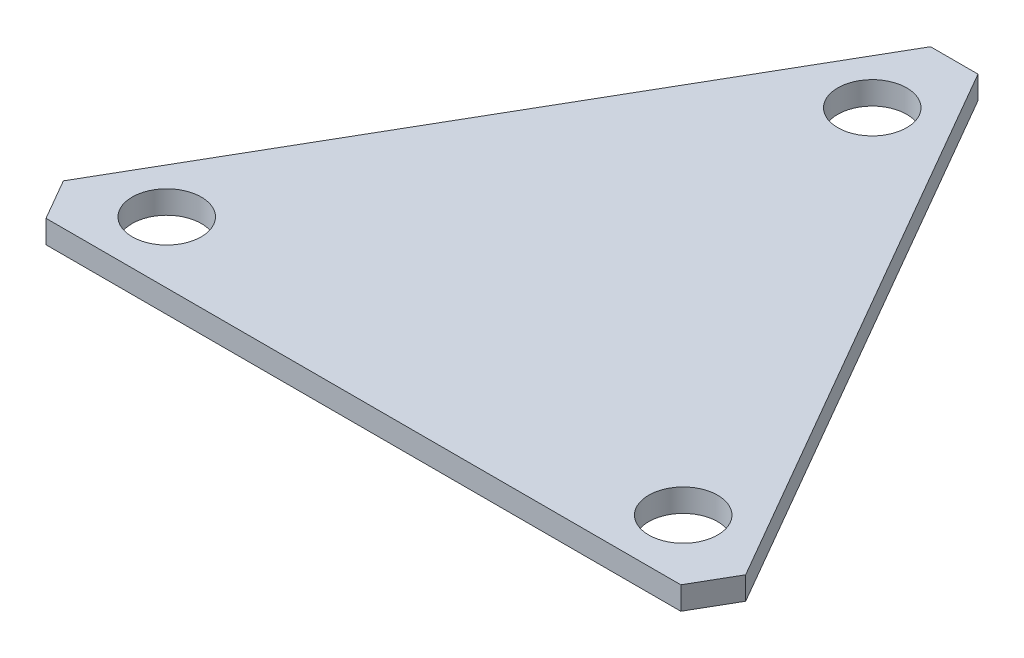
ISO-10303-21;
HEADER;
FILE_DESCRIPTION(('STEP AP214'),'2;1');
FILE_NAME('part.step','',(''),(''),'','','');
FILE_SCHEMA(('AUTOMOTIVE_DESIGN { 1 0 10303 214 1 1 1 1 }'));
ENDSEC;
DATA;
#1=APPLICATION_CONTEXT('core data for automotive mechanical design processes');
#2=APPLICATION_PROTOCOL_DEFINITION('international standard','automotive_design',2000,#1);
#3=PRODUCT_CONTEXT('',#1,'mechanical');
#4=PRODUCT('Part','Part','',(#3));
#5=PRODUCT_RELATED_PRODUCT_CATEGORY('part','',(#4));
#6=PRODUCT_DEFINITION_FORMATION('','',#4);
#7=PRODUCT_DEFINITION_CONTEXT('part definition',#1,'design');
#8=PRODUCT_DEFINITION('design','',#6,#7);
#9=PRODUCT_DEFINITION_SHAPE('','',#8);
#10=(LENGTH_UNIT() NAMED_UNIT(*) SI_UNIT(.MILLI.,.METRE.));
#11=(NAMED_UNIT(*) PLANE_ANGLE_UNIT() SI_UNIT($,.RADIAN.));
#12=(NAMED_UNIT(*) SI_UNIT($,.STERADIAN.) SOLID_ANGLE_UNIT());
#13=UNCERTAINTY_MEASURE_WITH_UNIT(LENGTH_MEASURE(1.E-05),#10,'distance_accuracy_value','');
#14=(GEOMETRIC_REPRESENTATION_CONTEXT(3) GLOBAL_UNCERTAINTY_ASSIGNED_CONTEXT((#13)) GLOBAL_UNIT_ASSIGNED_CONTEXT((#10,
#11,#12)) REPRESENTATION_CONTEXT('',''));
#15=CARTESIAN_POINT('',(0.,0.,0.));
#16=DIRECTION('',(0.,0.,1.));
#17=DIRECTION('',(1.,0.,0.));
#18=AXIS2_PLACEMENT_3D('',#15,#16,#17);
#19=CARTESIAN_POINT('',(-1.64251809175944,1.5875,-26.3143584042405));
#20=DIRECTION('',(0.866025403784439,0.,0.5));
#21=DIRECTION('',(0.5,0.,-0.866025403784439));
#22=AXIS2_PLACEMENT_3D('',#19,#20,#21);
#23=PLANE('',#22);
#24=DIRECTION('',(-0.5,0.,0.866025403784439));
#25=VECTOR('',#24,1.);
#26=CARTESIAN_POINT('',(-1.64251809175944,0.,-26.3143584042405));
#27=LINE('',#26,#25);
#28=CARTESIAN_POINT('',(-1.64251809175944,0.,-26.3143584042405));
#29=VERTEX_POINT('',#28);
#30=CARTESIAN_POINT('',(-23.6101619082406,0.,11.7347168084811));
#31=VERTEX_POINT('',#30);
#32=EDGE_CURVE('E116',#29,#31,#27,.T.);
#33=ORIENTED_EDGE('',*,*,#32,.T.);
#34=DIRECTION('',(0.,-1.,0.));
#35=VECTOR('',#34,1.);
#36=CARTESIAN_POINT('',(-23.6101619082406,1.5875,11.7347168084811));
#37=LINE('',#36,#35);
#38=CARTESIAN_POINT('',(-23.6101619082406,1.5875,11.7347168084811));
#39=VERTEX_POINT('',#38);
#40=EDGE_CURVE('E11',#39,#31,#37,.T.);
#41=ORIENTED_EDGE('',*,*,#40,.F.);
#42=DIRECTION('',(-0.5,0.,0.866025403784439));
#43=VECTOR('',#42,1.);
#44=CARTESIAN_POINT('',(-1.64251809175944,1.5875,-26.3143584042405));
#45=LINE('',#44,#43);
#46=CARTESIAN_POINT('',(-1.64251809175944,1.5875,-26.3143584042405));
#47=VERTEX_POINT('',#46);
#48=EDGE_CURVE('E127',#47,#39,#45,.T.);
#49=ORIENTED_EDGE('',*,*,#48,.F.);
#50=DIRECTION('',(0.,-1.,0.));
#51=VECTOR('',#50,1.);
#52=CARTESIAN_POINT('',(-1.64251809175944,1.5875,-26.3143584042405));
#53=LINE('',#52,#51);
#54=EDGE_CURVE('E112',#47,#29,#53,.T.);
#55=ORIENTED_EDGE('',*,*,#54,.T.);
#56=EDGE_LOOP('',(#33,#41,#49,#55));
#57=FACE_BOUND('',#56,.T.);
#58=ADVANCED_FACE('F32',(#57),#23,.F.);
#59=CARTESIAN_POINT('',(-23.6101619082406,1.5875,11.7347168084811));
#60=DIRECTION('',(0.866025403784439,0.,-0.5));
#61=DIRECTION('',(-0.5,0.,-0.866025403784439));
#62=AXIS2_PLACEMENT_3D('',#59,#60,#61);
#63=PLANE('',#62);
#64=DIRECTION('',(0.5,0.,0.866025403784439));
#65=VECTOR('',#64,1.);
#66=CARTESIAN_POINT('',(-23.6101619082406,0.,11.7347168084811));
#67=LINE('',#66,#65);
#68=CARTESIAN_POINT('',(-21.9676438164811,0.,14.5796415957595));
#69=VERTEX_POINT('',#68);
#70=EDGE_CURVE('E119',#31,#69,#67,.T.);
#71=ORIENTED_EDGE('',*,*,#70,.T.);
#72=DIRECTION('',(0.,-1.,0.));
#73=VECTOR('',#72,1.);
#74=CARTESIAN_POINT('',(-21.9676438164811,1.5875,14.5796415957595));
#75=LINE('',#74,#73);
#76=CARTESIAN_POINT('',(-21.9676438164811,1.5875,14.5796415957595));
#77=VERTEX_POINT('',#76);
#78=EDGE_CURVE('E40',#77,#69,#75,.T.);
#79=ORIENTED_EDGE('',*,*,#78,.F.);
#80=DIRECTION('',(0.5,0.,0.866025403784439));
#81=VECTOR('',#80,1.);
#82=CARTESIAN_POINT('',(-23.6101619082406,1.5875,11.7347168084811));
#83=LINE('',#82,#81);
#84=EDGE_CURVE('E85',#39,#77,#83,.T.);
#85=ORIENTED_EDGE('',*,*,#84,.F.);
#86=ORIENTED_EDGE('',*,*,#40,.T.);
#87=EDGE_LOOP('',(#71,#79,#85,#86));
#88=FACE_BOUND('',#87,.T.);
#89=ADVANCED_FACE('F152',(#88),#63,.F.);
#90=CARTESIAN_POINT('',(-21.9676438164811,1.5875,14.5796415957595));
#91=DIRECTION('',(0.,0.,-1.));
#92=DIRECTION('',(-1.,0.,0.));
#93=AXIS2_PLACEMENT_3D('',#90,#91,#92);
#94=PLANE('',#93);
#95=DIRECTION('',(1.,0.,0.));
#96=VECTOR('',#95,1.);
#97=CARTESIAN_POINT('',(-21.9676438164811,0.,14.5796415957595));
#98=LINE('',#97,#96);
#99=CARTESIAN_POINT('',(21.9676438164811,0.,14.5796415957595));
#100=VERTEX_POINT('',#99);
#101=EDGE_CURVE('E122',#69,#100,#98,.T.);
#102=ORIENTED_EDGE('',*,*,#101,.T.);
#103=DIRECTION('',(0.,-1.,0.));
#104=VECTOR('',#103,1.);
#105=CARTESIAN_POINT('',(21.9676438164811,1.5875,14.5796415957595));
#106=LINE('',#105,#104);
#107=CARTESIAN_POINT('',(21.9676438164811,1.5875,14.5796415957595));
#108=VERTEX_POINT('',#107);
#109=EDGE_CURVE('E107',#108,#100,#106,.T.);
#110=ORIENTED_EDGE('',*,*,#109,.F.);
#111=DIRECTION('',(1.,0.,0.));
#112=VECTOR('',#111,1.);
#113=CARTESIAN_POINT('',(-21.9676438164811,1.5875,14.5796415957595));
#114=LINE('',#113,#112);
#115=EDGE_CURVE('E98',#77,#108,#114,.T.);
#116=ORIENTED_EDGE('',*,*,#115,.F.);
#117=ORIENTED_EDGE('',*,*,#78,.T.);
#118=EDGE_LOOP('',(#102,#110,#116,#117));
#119=FACE_BOUND('',#118,.T.);
#120=ADVANCED_FACE('F133',(#119),#94,.F.);
#121=CARTESIAN_POINT('',(23.6101619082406,1.5875,11.734716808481));
#122=DIRECTION('',(-0.866025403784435,0.,-0.500000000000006));
#123=DIRECTION('',(-0.500000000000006,0.,0.866025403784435));
#124=AXIS2_PLACEMENT_3D('',#121,#122,#123);
#125=PLANE('',#124);
#126=DIRECTION('',(0.500000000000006,0.,-0.866025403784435));
#127=VECTOR('',#126,1.);
#128=CARTESIAN_POINT('',(23.6101619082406,0.,11.734716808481));
#129=LINE('',#128,#127);
#130=CARTESIAN_POINT('',(23.6101619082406,0.,11.734716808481));
#131=VERTEX_POINT('',#130);
#132=EDGE_CURVE('E106',#100,#131,#129,.T.);
#133=ORIENTED_EDGE('',*,*,#132,.T.);
#134=DIRECTION('',(0.,-1.,0.));
#135=VECTOR('',#134,1.);
#136=CARTESIAN_POINT('',(23.6101619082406,1.5875,11.734716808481));
#137=LINE('',#136,#135);
#138=CARTESIAN_POINT('',(23.6101619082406,1.5875,11.734716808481));
#139=VERTEX_POINT('',#138);
#140=EDGE_CURVE('E103',#139,#131,#137,.T.);
#141=ORIENTED_EDGE('',*,*,#140,.F.);
#142=DIRECTION('',(0.500000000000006,0.,-0.866025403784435));
#143=VECTOR('',#142,1.);
#144=CARTESIAN_POINT('',(23.6101619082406,1.5875,11.734716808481));
#145=LINE('',#144,#143);
#146=EDGE_CURVE('E92',#108,#139,#145,.T.);
#147=ORIENTED_EDGE('',*,*,#146,.F.);
#148=ORIENTED_EDGE('',*,*,#109,.T.);
#149=EDGE_LOOP('',(#133,#141,#147,#148));
#150=FACE_BOUND('',#149,.T.);
#151=ADVANCED_FACE('F104',(#150),#125,.F.);
#152=CARTESIAN_POINT('',(23.6101619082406,1.5875,11.734716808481));
#153=DIRECTION('',(-0.866025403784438,0.,0.5));
#154=DIRECTION('',(0.500000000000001,0.,0.866025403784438));
#155=AXIS2_PLACEMENT_3D('',#152,#153,#154);
#156=PLANE('',#155);
#157=DIRECTION('',(-0.5,0.,-0.866025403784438));
#158=VECTOR('',#157,1.);
#159=CARTESIAN_POINT('',(23.6101619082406,0.,11.734716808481));
#160=LINE('',#159,#158);
#161=CARTESIAN_POINT('',(1.64251809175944,0.,-26.3143584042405));
#162=VERTEX_POINT('',#161);
#163=EDGE_CURVE('E71',#131,#162,#160,.T.);
#164=ORIENTED_EDGE('',*,*,#163,.T.);
#165=DIRECTION('',(0.,-1.,0.));
#166=VECTOR('',#165,1.);
#167=CARTESIAN_POINT('',(1.64251809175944,1.5875,-26.3143584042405));
#168=LINE('',#167,#166);
#169=CARTESIAN_POINT('',(1.64251809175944,1.5875,-26.3143584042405));
#170=VERTEX_POINT('',#169);
#171=EDGE_CURVE('E108',#170,#162,#168,.T.);
#172=ORIENTED_EDGE('',*,*,#171,.F.);
#173=DIRECTION('',(-0.5,0.,-0.866025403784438));
#174=VECTOR('',#173,1.);
#175=CARTESIAN_POINT('',(23.6101619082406,1.5875,11.734716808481));
#176=LINE('',#175,#174);
#177=EDGE_CURVE('E96',#139,#170,#176,.T.);
#178=ORIENTED_EDGE('',*,*,#177,.F.);
#179=ORIENTED_EDGE('',*,*,#140,.T.);
#180=EDGE_LOOP('',(#164,#172,#178,#179));
#181=FACE_BOUND('',#180,.T.);
#182=ADVANCED_FACE('F110',(#181),#156,.F.);
#183=CARTESIAN_POINT('',(-1.64251809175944,1.5875,-26.3143584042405));
#184=DIRECTION('',(0.,0.,1.));
#185=DIRECTION('',(1.,0.,0.));
#186=AXIS2_PLACEMENT_3D('',#183,#184,#185);
#187=PLANE('',#186);
#188=DIRECTION('',(-1.,0.,0.));
#189=VECTOR('',#188,1.);
#190=CARTESIAN_POINT('',(-1.64251809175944,0.,-26.3143584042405));
#191=LINE('',#190,#189);
#192=EDGE_CURVE('E77',#162,#29,#191,.T.);
#193=ORIENTED_EDGE('',*,*,#192,.T.);
#194=ORIENTED_EDGE('',*,*,#54,.F.);
#195=DIRECTION('',(-1.,0.,0.));
#196=VECTOR('',#195,1.);
#197=CARTESIAN_POINT('',(-1.64251809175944,1.5875,-26.3143584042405));
#198=LINE('',#197,#196);
#199=EDGE_CURVE('E48',#170,#47,#198,.T.);
#200=ORIENTED_EDGE('',*,*,#199,.F.);
#201=ORIENTED_EDGE('',*,*,#171,.T.);
#202=EDGE_LOOP('',(#193,#194,#200,#201));
#203=FACE_BOUND('',#202,.T.);
#204=ADVANCED_FACE('F140',(#203),#187,.F.);
#205=CARTESIAN_POINT('',(0.,1.5875,-29.1592831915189));
#206=DIRECTION('',(0.,-1.,0.));
#207=DIRECTION('',(0.,0.,-1.));
#208=AXIS2_PLACEMENT_3D('',#205,#206,#207);
#209=PLANE('',#208);
#210=CARTESIAN_POINT('',(17.8725992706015,1.5875,10.3187499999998));
#211=DIRECTION('',(0.,1.,0.));
#212=DIRECTION('',(0.,0.,1.));
#213=AXIS2_PLACEMENT_3D('',#210,#211,#212);
#214=CIRCLE('',#213,2.3876);
#215=CARTESIAN_POINT('',(17.8725992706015,1.5875,12.7063499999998));
#216=VERTEX_POINT('',#215);
#217=EDGE_CURVE('E228',#216,#216,#214,.T.);
#218=ORIENTED_EDGE('',*,*,#217,.F.);
#219=EDGE_LOOP('',(#218));
#220=FACE_BOUND('',#219,.T.);
#221=CARTESIAN_POINT('',(-17.8725992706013,1.5875,10.3187500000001));
#222=DIRECTION('',(0.,1.,0.));
#223=DIRECTION('',(0.,0.,1.));
#224=AXIS2_PLACEMENT_3D('',#221,#222,#223);
#225=CIRCLE('',#224,2.3876);
#226=CARTESIAN_POINT('',(-17.8725992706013,1.5875,12.7063500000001));
#227=VERTEX_POINT('',#226);
#228=EDGE_CURVE('E230',#227,#227,#225,.T.);
#229=ORIENTED_EDGE('',*,*,#228,.F.);
#230=EDGE_LOOP('',(#229));
#231=FACE_BOUND('',#230,.T.);
#232=CARTESIAN_POINT('',(0.,1.5875,-20.6375));
#233=DIRECTION('',(0.,1.,0.));
#234=DIRECTION('',(0.,0.,1.));
#235=AXIS2_PLACEMENT_3D('',#232,#233,#234);
#236=CIRCLE('',#235,2.3876);
#237=CARTESIAN_POINT('',(0.,1.5875,-18.2499));
#238=VERTEX_POINT('',#237);
#239=EDGE_CURVE('E236',#238,#238,#236,.T.);
#240=ORIENTED_EDGE('',*,*,#239,.F.);
#241=EDGE_LOOP('',(#240));
#242=FACE_BOUND('',#241,.T.);
#243=ORIENTED_EDGE('',*,*,#48,.T.);
#244=ORIENTED_EDGE('',*,*,#84,.T.);
#245=ORIENTED_EDGE('',*,*,#115,.T.);
#246=ORIENTED_EDGE('',*,*,#146,.T.);
#247=ORIENTED_EDGE('',*,*,#177,.T.);
#248=ORIENTED_EDGE('',*,*,#199,.T.);
#249=EDGE_LOOP('',(#243,#244,#245,#246,#247,#248));
#250=FACE_BOUND('',#249,.T.);
#251=ADVANCED_FACE('F94',(#220,#231,#242,#250),#209,.F.);
#252=CARTESIAN_POINT('',(0.,0.,-29.1592831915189));
#253=DIRECTION('',(0.,-1.,0.));
#254=DIRECTION('',(0.,0.,-1.));
#255=AXIS2_PLACEMENT_3D('',#252,#253,#254);
#256=PLANE('',#255);
#257=CARTESIAN_POINT('',(17.8725992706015,0.,10.3187499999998));
#258=DIRECTION('',(0.,1.,0.));
#259=DIRECTION('',(0.,0.,1.));
#260=AXIS2_PLACEMENT_3D('',#257,#258,#259);
#261=CIRCLE('',#260,2.3876);
#262=CARTESIAN_POINT('',(17.8725992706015,0.,12.7063499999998));
#263=VERTEX_POINT('',#262);
#264=EDGE_CURVE('E225',#263,#263,#261,.T.);
#265=ORIENTED_EDGE('',*,*,#264,.T.);
#266=EDGE_LOOP('',(#265));
#267=FACE_BOUND('',#266,.T.);
#268=CARTESIAN_POINT('',(-17.8725992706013,0.,10.3187500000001));
#269=DIRECTION('',(0.,1.,0.));
#270=DIRECTION('',(0.,0.,1.));
#271=AXIS2_PLACEMENT_3D('',#268,#269,#270);
#272=CIRCLE('',#271,2.3876);
#273=CARTESIAN_POINT('',(-17.8725992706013,0.,12.7063500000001));
#274=VERTEX_POINT('',#273);
#275=EDGE_CURVE('E233',#274,#274,#272,.T.);
#276=ORIENTED_EDGE('',*,*,#275,.T.);
#277=EDGE_LOOP('',(#276));
#278=FACE_BOUND('',#277,.T.);
#279=CARTESIAN_POINT('',(0.,0.,-20.6375));
#280=DIRECTION('',(0.,1.,0.));
#281=DIRECTION('',(0.,0.,1.));
#282=AXIS2_PLACEMENT_3D('',#279,#280,#281);
#283=CIRCLE('',#282,2.3876);
#284=CARTESIAN_POINT('',(0.,0.,-18.2499));
#285=VERTEX_POINT('',#284);
#286=EDGE_CURVE('E120',#285,#285,#283,.T.);
#287=ORIENTED_EDGE('',*,*,#286,.T.);
#288=EDGE_LOOP('',(#287));
#289=FACE_BOUND('',#288,.T.);
#290=ORIENTED_EDGE('',*,*,#32,.F.);
#291=ORIENTED_EDGE('',*,*,#192,.F.);
#292=ORIENTED_EDGE('',*,*,#163,.F.);
#293=ORIENTED_EDGE('',*,*,#132,.F.);
#294=ORIENTED_EDGE('',*,*,#101,.F.);
#295=ORIENTED_EDGE('',*,*,#70,.F.);
#296=EDGE_LOOP('',(#290,#291,#292,#293,#294,#295));
#297=FACE_BOUND('',#296,.T.);
#298=ADVANCED_FACE('F136',(#267,#278,#289,#297),#256,.T.);
#299=CARTESIAN_POINT('',(0.,0.,-20.6375));
#300=DIRECTION('',(0.,1.,0.));
#301=DIRECTION('',(0.,0.,1.));
#302=AXIS2_PLACEMENT_3D('',#299,#300,#301);
#303=CYLINDRICAL_SURFACE('',#302,2.3876);
#304=ORIENTED_EDGE('',*,*,#286,.F.);
#305=EDGE_LOOP('',(#304));
#306=FACE_BOUND('',#305,.T.);
#307=ORIENTED_EDGE('',*,*,#239,.T.);
#308=EDGE_LOOP('',(#307));
#309=FACE_BOUND('',#308,.T.);
#310=ADVANCED_FACE('F189',(#306,#309),#303,.F.);
#311=CARTESIAN_POINT('',(-17.8725992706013,0.,10.3187500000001));
#312=DIRECTION('',(0.,1.,0.));
#313=DIRECTION('',(0.,0.,1.));
#314=AXIS2_PLACEMENT_3D('',#311,#312,#313);
#315=CYLINDRICAL_SURFACE('',#314,2.3876);
#316=ORIENTED_EDGE('',*,*,#275,.F.);
#317=EDGE_LOOP('',(#316));
#318=FACE_BOUND('',#317,.T.);
#319=ORIENTED_EDGE('',*,*,#228,.T.);
#320=EDGE_LOOP('',(#319));
#321=FACE_BOUND('',#320,.T.);
#322=ADVANCED_FACE('F198',(#318,#321),#315,.F.);
#323=CARTESIAN_POINT('',(17.8725992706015,0.,10.3187499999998));
#324=DIRECTION('',(0.,1.,0.));
#325=DIRECTION('',(0.,0.,1.));
#326=AXIS2_PLACEMENT_3D('',#323,#324,#325);
#327=CYLINDRICAL_SURFACE('',#326,2.3876);
#328=ORIENTED_EDGE('',*,*,#264,.F.);
#329=EDGE_LOOP('',(#328));
#330=FACE_BOUND('',#329,.T.);
#331=ORIENTED_EDGE('',*,*,#217,.T.);
#332=EDGE_LOOP('',(#331));
#333=FACE_BOUND('',#332,.T.);
#334=ADVANCED_FACE('F208',(#330,#333),#327,.F.);
#335=CLOSED_SHELL('',(#58,#89,#120,#151,#182,#204,#251,#298,#310,#322,#334));
#336=MANIFOLD_SOLID_BREP('B2',#335);
#337=ADVANCED_BREP_SHAPE_REPRESENTATION('',(#18,#336),#14);
#338=SHAPE_DEFINITION_REPRESENTATION(#9,#337);
ENDSEC;
END-ISO-10303-21;
